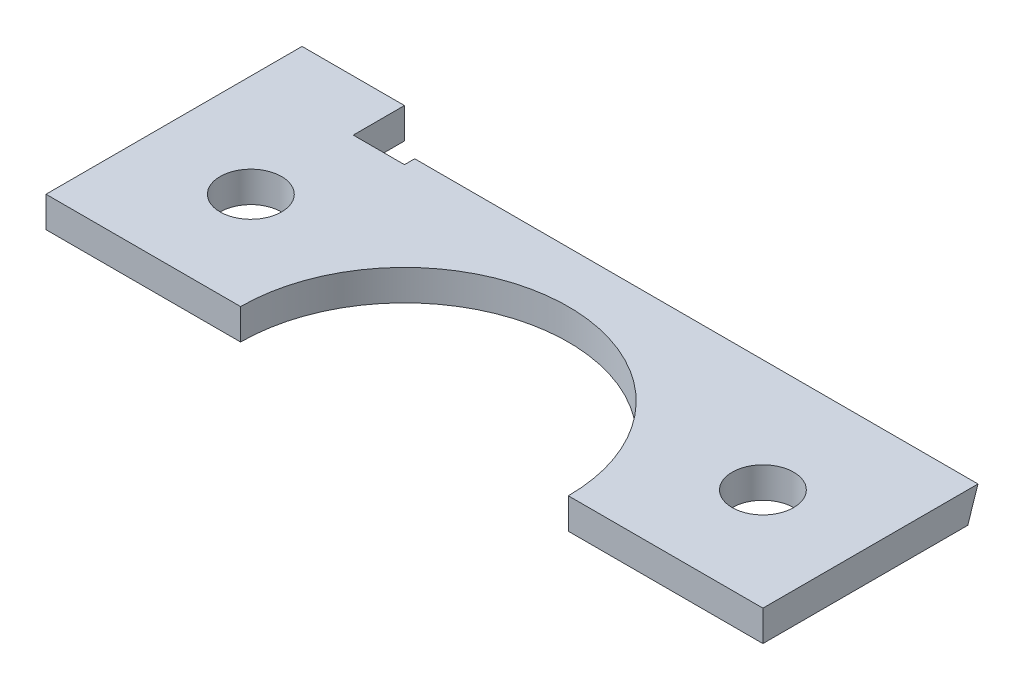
ISO-10303-21;
HEADER;
FILE_DESCRIPTION(('STEP AP214'),'2;1');
FILE_NAME('part.step','',(''),(''),'','','');
FILE_SCHEMA(('AUTOMOTIVE_DESIGN { 1 0 10303 214 1 1 1 1 }'));
ENDSEC;
DATA;
#1=APPLICATION_CONTEXT('core data for automotive mechanical design processes');
#2=APPLICATION_PROTOCOL_DEFINITION('international standard','automotive_design',2000,#1);
#3=PRODUCT_CONTEXT('',#1,'mechanical');
#4=PRODUCT('Part','Part','',(#3));
#5=PRODUCT_RELATED_PRODUCT_CATEGORY('part','',(#4));
#6=PRODUCT_DEFINITION_FORMATION('','',#4);
#7=PRODUCT_DEFINITION_CONTEXT('part definition',#1,'design');
#8=PRODUCT_DEFINITION('design','',#6,#7);
#9=PRODUCT_DEFINITION_SHAPE('','',#8);
#10=(LENGTH_UNIT() NAMED_UNIT(*) SI_UNIT(.MILLI.,.METRE.));
#11=(NAMED_UNIT(*) PLANE_ANGLE_UNIT() SI_UNIT($,.RADIAN.));
#12=(NAMED_UNIT(*) SI_UNIT($,.STERADIAN.) SOLID_ANGLE_UNIT());
#13=UNCERTAINTY_MEASURE_WITH_UNIT(LENGTH_MEASURE(1.E-05),#10,'distance_accuracy_value','');
#14=(GEOMETRIC_REPRESENTATION_CONTEXT(3) GLOBAL_UNCERTAINTY_ASSIGNED_CONTEXT((#13)) GLOBAL_UNIT_ASSIGNED_CONTEXT((#10,
#11,#12)) REPRESENTATION_CONTEXT('',''));
#15=CARTESIAN_POINT('',(0.,0.,0.));
#16=DIRECTION('',(0.,0.,1.));
#17=DIRECTION('',(1.,0.,0.));
#18=AXIS2_PLACEMENT_3D('',#15,#16,#17);
#19=CARTESIAN_POINT('',(35.,3.,0.));
#20=DIRECTION('',(0.,1.,0.));
#21=DIRECTION('',(0.,0.,1.));
#22=AXIS2_PLACEMENT_3D('',#19,#20,#21);
#23=PLANE('',#22);
#24=CARTESIAN_POINT('',(10.,3.,-10.));
#25=DIRECTION('',(0.,1.,0.));
#26=DIRECTION('',(0.,0.,1.));
#27=AXIS2_PLACEMENT_3D('',#24,#25,#26);
#28=CIRCLE('',#27,3.);
#29=CARTESIAN_POINT('',(10.,3.,-7.));
#30=VERTEX_POINT('',#29);
#31=EDGE_CURVE('E189',#30,#30,#28,.T.);
#32=ORIENTED_EDGE('',*,*,#31,.F.);
#33=EDGE_LOOP('',(#32));
#34=FACE_BOUND('',#33,.T.);
#35=DIRECTION('',(0.,0.,1.));
#36=VECTOR('',#35,1.);
#37=CARTESIAN_POINT('',(0.,3.,0.));
#38=LINE('',#37,#36);
#39=CARTESIAN_POINT('',(0.,3.,-25.));
#40=VERTEX_POINT('',#39);
#41=CARTESIAN_POINT('',(0.,3.,0.));
#42=VERTEX_POINT('',#41);
#43=EDGE_CURVE('E142',#40,#42,#38,.T.);
#44=ORIENTED_EDGE('',*,*,#43,.T.);
#45=DIRECTION('',(1.,0.,0.));
#46=VECTOR('',#45,1.);
#47=CARTESIAN_POINT('',(0.,3.,0.));
#48=LINE('',#47,#46);
#49=CARTESIAN_POINT('',(19.,3.,0.));
#50=VERTEX_POINT('',#49);
#51=EDGE_CURVE('E144',#42,#50,#48,.T.);
#52=ORIENTED_EDGE('',*,*,#51,.T.);
#53=CARTESIAN_POINT('',(35.,3.,0.));
#54=DIRECTION('',(0.,-1.,0.));
#55=DIRECTION('',(0.,0.,1.));
#56=AXIS2_PLACEMENT_3D('',#53,#54,#55);
#57=CIRCLE('',#56,16.);
#58=CARTESIAN_POINT('',(51.,3.,0.));
#59=VERTEX_POINT('',#58);
#60=EDGE_CURVE('E146',#50,#59,#57,.T.);
#61=ORIENTED_EDGE('',*,*,#60,.T.);
#62=DIRECTION('',(1.,0.,0.));
#63=VECTOR('',#62,1.);
#64=CARTESIAN_POINT('',(51.,3.,0.));
#65=LINE('',#64,#63);
#66=CARTESIAN_POINT('',(70.,3.,0.));
#67=VERTEX_POINT('',#66);
#68=EDGE_CURVE('E148',#59,#67,#65,.T.);
#69=ORIENTED_EDGE('',*,*,#68,.T.);
#70=DIRECTION('',(0.,0.,-1.));
#71=VECTOR('',#70,1.);
#72=CARTESIAN_POINT('',(70.,3.,0.));
#73=LINE('',#72,#71);
#74=CARTESIAN_POINT('',(70.,3.,-21.));
#75=VERTEX_POINT('',#74);
#76=EDGE_CURVE('E150',#67,#75,#73,.T.);
#77=ORIENTED_EDGE('',*,*,#76,.T.);
#78=DIRECTION('',(-1.,0.,0.));
#79=VECTOR('',#78,1.);
#80=CARTESIAN_POINT('',(15.,3.,-21.));
#81=LINE('',#80,#79);
#82=CARTESIAN_POINT('',(15.,3.,-21.));
#83=VERTEX_POINT('',#82);
#84=EDGE_CURVE('E109',#75,#83,#81,.T.);
#85=ORIENTED_EDGE('',*,*,#84,.T.);
#86=DIRECTION('',(0.,0.,1.));
#87=VECTOR('',#86,1.);
#88=CARTESIAN_POINT('',(15.,3.,-20.));
#89=LINE('',#88,#87);
#90=CARTESIAN_POINT('',(15.,3.,-20.));
#91=VERTEX_POINT('',#90);
#92=EDGE_CURVE('E153',#83,#91,#89,.T.);
#93=ORIENTED_EDGE('',*,*,#92,.T.);
#94=DIRECTION('',(-1.,0.,0.));
#95=VECTOR('',#94,1.);
#96=CARTESIAN_POINT('',(10.,3.,-20.));
#97=LINE('',#96,#95);
#98=CARTESIAN_POINT('',(10.,3.,-20.));
#99=VERTEX_POINT('',#98);
#100=EDGE_CURVE('E155',#91,#99,#97,.T.);
#101=ORIENTED_EDGE('',*,*,#100,.T.);
#102=DIRECTION('',(0.,0.,-1.));
#103=VECTOR('',#102,1.);
#104=CARTESIAN_POINT('',(10.,3.,-20.));
#105=LINE('',#104,#103);
#106=CARTESIAN_POINT('',(10.,3.,-25.));
#107=VERTEX_POINT('',#106);
#108=EDGE_CURVE('E50',#99,#107,#105,.T.);
#109=ORIENTED_EDGE('',*,*,#108,.T.);
#110=DIRECTION('',(-1.,0.,0.));
#111=VECTOR('',#110,1.);
#112=CARTESIAN_POINT('',(0.,3.,-25.));
#113=LINE('',#112,#111);
#114=EDGE_CURVE('E45',#107,#40,#113,.T.);
#115=ORIENTED_EDGE('',*,*,#114,.T.);
#116=EDGE_LOOP('',(#44,#52,#61,#69,#77,#85,#93,#101,#109,#115));
#117=FACE_BOUND('',#116,.T.);
#118=CARTESIAN_POINT('',(60.,3.,-10.));
#119=DIRECTION('',(0.,1.,0.));
#120=DIRECTION('',(0.,0.,1.));
#121=AXIS2_PLACEMENT_3D('',#118,#119,#120);
#122=CIRCLE('',#121,3.00000000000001);
#123=CARTESIAN_POINT('',(60.,3.,-6.99999999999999));
#124=VERTEX_POINT('',#123);
#125=EDGE_CURVE('E195',#124,#124,#122,.T.);
#126=ORIENTED_EDGE('',*,*,#125,.F.);
#127=EDGE_LOOP('',(#126));
#128=FACE_BOUND('',#127,.T.);
#129=ADVANCED_FACE('F30',(#34,#117,#128),#23,.T.);
#130=CARTESIAN_POINT('',(35.,0.,0.));
#131=DIRECTION('',(0.,1.,0.));
#132=DIRECTION('',(0.,0.,1.));
#133=AXIS2_PLACEMENT_3D('',#130,#131,#132);
#134=PLANE('',#133);
#135=CARTESIAN_POINT('',(10.,0.,-10.));
#136=DIRECTION('',(0.,1.,0.));
#137=DIRECTION('',(0.,0.,1.));
#138=AXIS2_PLACEMENT_3D('',#135,#136,#137);
#139=CIRCLE('',#138,3.);
#140=CARTESIAN_POINT('',(10.,0.,-7.));
#141=VERTEX_POINT('',#140);
#142=EDGE_CURVE('E192',#141,#141,#139,.T.);
#143=ORIENTED_EDGE('',*,*,#142,.T.);
#144=EDGE_LOOP('',(#143));
#145=FACE_BOUND('',#144,.T.);
#146=DIRECTION('',(-1.,0.,0.));
#147=VECTOR('',#146,1.);
#148=CARTESIAN_POINT('',(10.,0.,-20.));
#149=LINE('',#148,#147);
#150=CARTESIAN_POINT('',(15.,0.,-20.));
#151=VERTEX_POINT('',#150);
#152=CARTESIAN_POINT('',(10.,0.,-20.));
#153=VERTEX_POINT('',#152);
#154=EDGE_CURVE('E124',#151,#153,#149,.T.);
#155=ORIENTED_EDGE('',*,*,#154,.F.);
#156=DIRECTION('',(1.,0.,0.));
#157=VECTOR('',#156,1.);
#158=CARTESIAN_POINT('',(15.,0.,-20.));
#159=LINE('',#158,#157);
#160=CARTESIAN_POINT('',(70.,0.,-20.));
#161=VERTEX_POINT('',#160);
#162=EDGE_CURVE('E106',#151,#161,#159,.T.);
#163=ORIENTED_EDGE('',*,*,#162,.T.);
#164=DIRECTION('',(0.,0.,-1.));
#165=VECTOR('',#164,1.);
#166=CARTESIAN_POINT('',(70.,0.,0.));
#167=LINE('',#166,#165);
#168=CARTESIAN_POINT('',(70.,0.,0.));
#169=VERTEX_POINT('',#168);
#170=EDGE_CURVE('E122',#169,#161,#167,.T.);
#171=ORIENTED_EDGE('',*,*,#170,.F.);
#172=DIRECTION('',(1.,0.,0.));
#173=VECTOR('',#172,1.);
#174=CARTESIAN_POINT('',(51.,0.,0.));
#175=LINE('',#174,#173);
#176=CARTESIAN_POINT('',(51.,0.,0.));
#177=VERTEX_POINT('',#176);
#178=EDGE_CURVE('E131',#177,#169,#175,.T.);
#179=ORIENTED_EDGE('',*,*,#178,.F.);
#180=CARTESIAN_POINT('',(35.,0.,0.));
#181=DIRECTION('',(0.,-1.,0.));
#182=DIRECTION('',(0.,0.,1.));
#183=AXIS2_PLACEMENT_3D('',#180,#181,#182);
#184=CIRCLE('',#183,16.);
#185=CARTESIAN_POINT('',(19.,0.,0.));
#186=VERTEX_POINT('',#185);
#187=EDGE_CURVE('E135',#186,#177,#184,.T.);
#188=ORIENTED_EDGE('',*,*,#187,.F.);
#189=DIRECTION('',(1.,0.,0.));
#190=VECTOR('',#189,1.);
#191=CARTESIAN_POINT('',(0.,0.,0.));
#192=LINE('',#191,#190);
#193=CARTESIAN_POINT('',(0.,0.,0.));
#194=VERTEX_POINT('',#193);
#195=EDGE_CURVE('E183',#194,#186,#192,.T.);
#196=ORIENTED_EDGE('',*,*,#195,.F.);
#197=DIRECTION('',(0.,0.,1.));
#198=VECTOR('',#197,1.);
#199=CARTESIAN_POINT('',(0.,0.,0.));
#200=LINE('',#199,#198);
#201=CARTESIAN_POINT('',(0.,0.,-25.));
#202=VERTEX_POINT('',#201);
#203=EDGE_CURVE('E184',#202,#194,#200,.T.);
#204=ORIENTED_EDGE('',*,*,#203,.F.);
#205=DIRECTION('',(-1.,0.,0.));
#206=VECTOR('',#205,1.);
#207=CARTESIAN_POINT('',(0.,0.,-25.));
#208=LINE('',#207,#206);
#209=CARTESIAN_POINT('',(10.,0.,-25.));
#210=VERTEX_POINT('',#209);
#211=EDGE_CURVE('E140',#210,#202,#208,.T.);
#212=ORIENTED_EDGE('',*,*,#211,.F.);
#213=DIRECTION('',(0.,0.,-1.));
#214=VECTOR('',#213,1.);
#215=CARTESIAN_POINT('',(10.,0.,-20.));
#216=LINE('',#215,#214);
#217=EDGE_CURVE('E133',#153,#210,#216,.T.);
#218=ORIENTED_EDGE('',*,*,#217,.F.);
#219=EDGE_LOOP('',(#155,#163,#171,#179,#188,#196,#204,#212,#218));
#220=FACE_BOUND('',#219,.T.);
#221=CARTESIAN_POINT('',(60.,0.,-10.));
#222=DIRECTION('',(0.,1.,0.));
#223=DIRECTION('',(0.,0.,1.));
#224=AXIS2_PLACEMENT_3D('',#221,#222,#223);
#225=CIRCLE('',#224,3.00000000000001);
#226=CARTESIAN_POINT('',(60.,0.,-6.99999999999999));
#227=VERTEX_POINT('',#226);
#228=EDGE_CURVE('E125',#227,#227,#225,.T.);
#229=ORIENTED_EDGE('',*,*,#228,.T.);
#230=EDGE_LOOP('',(#229));
#231=FACE_BOUND('',#230,.T.);
#232=ADVANCED_FACE('F119',(#145,#220,#231),#134,.F.);
#233=CARTESIAN_POINT('',(0.,3.,0.));
#234=DIRECTION('',(1.,0.,0.));
#235=DIRECTION('',(0.,0.,-1.));
#236=AXIS2_PLACEMENT_3D('',#233,#234,#235);
#237=PLANE('',#236);
#238=ORIENTED_EDGE('',*,*,#203,.T.);
#239=DIRECTION('',(0.,-1.,0.));
#240=VECTOR('',#239,1.);
#241=CARTESIAN_POINT('',(0.,3.,0.));
#242=LINE('',#241,#240);
#243=EDGE_CURVE('E11',#42,#194,#242,.T.);
#244=ORIENTED_EDGE('',*,*,#243,.F.);
#245=ORIENTED_EDGE('',*,*,#43,.F.);
#246=DIRECTION('',(0.,-1.,0.));
#247=VECTOR('',#246,1.);
#248=CARTESIAN_POINT('',(0.,3.,-25.));
#249=LINE('',#248,#247);
#250=EDGE_CURVE('E159',#40,#202,#249,.T.);
#251=ORIENTED_EDGE('',*,*,#250,.T.);
#252=EDGE_LOOP('',(#238,#244,#245,#251));
#253=FACE_BOUND('',#252,.T.);
#254=ADVANCED_FACE('F32',(#253),#237,.F.);
#255=CARTESIAN_POINT('',(0.,3.,0.));
#256=DIRECTION('',(0.,0.,-1.));
#257=DIRECTION('',(-1.,0.,0.));
#258=AXIS2_PLACEMENT_3D('',#255,#256,#257);
#259=PLANE('',#258);
#260=ORIENTED_EDGE('',*,*,#195,.T.);
#261=DIRECTION('',(0.,-1.,0.));
#262=VECTOR('',#261,1.);
#263=CARTESIAN_POINT('',(19.,3.,0.));
#264=LINE('',#263,#262);
#265=EDGE_CURVE('E38',#50,#186,#264,.T.);
#266=ORIENTED_EDGE('',*,*,#265,.F.);
#267=ORIENTED_EDGE('',*,*,#51,.F.);
#268=ORIENTED_EDGE('',*,*,#243,.T.);
#269=EDGE_LOOP('',(#260,#266,#267,#268));
#270=FACE_BOUND('',#269,.T.);
#271=ADVANCED_FACE('F219',(#270),#259,.F.);
#272=CARTESIAN_POINT('',(35.,3.,0.));
#273=DIRECTION('',(0.,-1.,0.));
#274=DIRECTION('',(0.,0.,-1.));
#275=AXIS2_PLACEMENT_3D('',#272,#273,#274);
#276=CYLINDRICAL_SURFACE('',#275,16.);
#277=ORIENTED_EDGE('',*,*,#187,.T.);
#278=DIRECTION('',(0.,-1.,0.));
#279=VECTOR('',#278,1.);
#280=CARTESIAN_POINT('',(51.,3.,0.));
#281=LINE('',#280,#279);
#282=EDGE_CURVE('E172',#59,#177,#281,.T.);
#283=ORIENTED_EDGE('',*,*,#282,.F.);
#284=ORIENTED_EDGE('',*,*,#60,.F.);
#285=ORIENTED_EDGE('',*,*,#265,.T.);
#286=EDGE_LOOP('',(#277,#283,#284,#285));
#287=FACE_BOUND('',#286,.T.);
#288=ADVANCED_FACE('F179',(#287),#276,.F.);
#289=CARTESIAN_POINT('',(51.,3.,0.));
#290=DIRECTION('',(0.,0.,-1.));
#291=DIRECTION('',(-1.,0.,0.));
#292=AXIS2_PLACEMENT_3D('',#289,#290,#291);
#293=PLANE('',#292);
#294=ORIENTED_EDGE('',*,*,#178,.T.);
#295=DIRECTION('',(0.,-1.,0.));
#296=VECTOR('',#295,1.);
#297=CARTESIAN_POINT('',(70.,3.,0.));
#298=LINE('',#297,#296);
#299=EDGE_CURVE('E130',#67,#169,#298,.T.);
#300=ORIENTED_EDGE('',*,*,#299,.F.);
#301=ORIENTED_EDGE('',*,*,#68,.F.);
#302=ORIENTED_EDGE('',*,*,#282,.T.);
#303=EDGE_LOOP('',(#294,#300,#301,#302));
#304=FACE_BOUND('',#303,.T.);
#305=ADVANCED_FACE('F211',(#304),#293,.F.);
#306=CARTESIAN_POINT('',(70.,3.,0.));
#307=DIRECTION('',(-1.,0.,0.));
#308=DIRECTION('',(0.,0.,1.));
#309=AXIS2_PLACEMENT_3D('',#306,#307,#308);
#310=PLANE('',#309);
#311=ORIENTED_EDGE('',*,*,#170,.T.);
#312=DIRECTION('',(0.,-0.948683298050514,0.316227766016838));
#313=VECTOR('',#312,1.);
#314=CARTESIAN_POINT('',(70.,0.,-20.));
#315=LINE('',#314,#313);
#316=EDGE_CURVE('E103',#75,#161,#315,.T.);
#317=ORIENTED_EDGE('',*,*,#316,.F.);
#318=ORIENTED_EDGE('',*,*,#76,.F.);
#319=ORIENTED_EDGE('',*,*,#299,.T.);
#320=EDGE_LOOP('',(#311,#317,#318,#319));
#321=FACE_BOUND('',#320,.T.);
#322=ADVANCED_FACE('F128',(#321),#310,.F.);
#323=CARTESIAN_POINT('',(15.,3.,-20.));
#324=DIRECTION('',(1.,0.,0.));
#325=DIRECTION('',(0.,0.,-1.));
#326=AXIS2_PLACEMENT_3D('',#323,#324,#325);
#327=PLANE('',#326);
#328=ORIENTED_EDGE('',*,*,#92,.F.);
#329=DIRECTION('',(0.,-0.948683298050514,0.316227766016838));
#330=VECTOR('',#329,1.);
#331=CARTESIAN_POINT('',(15.,0.,-20.));
#332=LINE('',#331,#330);
#333=EDGE_CURVE('E114',#83,#151,#332,.T.);
#334=ORIENTED_EDGE('',*,*,#333,.T.);
#335=DIRECTION('',(0.,-1.,0.));
#336=VECTOR('',#335,1.);
#337=CARTESIAN_POINT('',(15.,3.,-20.));
#338=LINE('',#337,#336);
#339=EDGE_CURVE('E168',#91,#151,#338,.T.);
#340=ORIENTED_EDGE('',*,*,#339,.F.);
#341=EDGE_LOOP('',(#328,#334,#340));
#342=FACE_BOUND('',#341,.T.);
#343=ADVANCED_FACE('F203',(#342),#327,.F.);
#344=CARTESIAN_POINT('',(10.,3.,-20.));
#345=DIRECTION('',(0.,0.,1.));
#346=DIRECTION('',(1.,0.,0.));
#347=AXIS2_PLACEMENT_3D('',#344,#345,#346);
#348=PLANE('',#347);
#349=ORIENTED_EDGE('',*,*,#154,.T.);
#350=DIRECTION('',(0.,-1.,0.));
#351=VECTOR('',#350,1.);
#352=CARTESIAN_POINT('',(10.,3.,-20.));
#353=LINE('',#352,#351);
#354=EDGE_CURVE('E165',#99,#153,#353,.T.);
#355=ORIENTED_EDGE('',*,*,#354,.F.);
#356=ORIENTED_EDGE('',*,*,#100,.F.);
#357=ORIENTED_EDGE('',*,*,#339,.T.);
#358=EDGE_LOOP('',(#349,#355,#356,#357));
#359=FACE_BOUND('',#358,.T.);
#360=ADVANCED_FACE('F206',(#359),#348,.F.);
#361=CARTESIAN_POINT('',(10.,3.,-20.));
#362=DIRECTION('',(-1.,0.,0.));
#363=DIRECTION('',(0.,0.,1.));
#364=AXIS2_PLACEMENT_3D('',#361,#362,#363);
#365=PLANE('',#364);
#366=ORIENTED_EDGE('',*,*,#217,.T.);
#367=DIRECTION('',(0.,-1.,0.));
#368=VECTOR('',#367,1.);
#369=CARTESIAN_POINT('',(10.,3.,-25.));
#370=LINE('',#369,#368);
#371=EDGE_CURVE('E162',#107,#210,#370,.T.);
#372=ORIENTED_EDGE('',*,*,#371,.F.);
#373=ORIENTED_EDGE('',*,*,#108,.F.);
#374=ORIENTED_EDGE('',*,*,#354,.T.);
#375=EDGE_LOOP('',(#366,#372,#373,#374));
#376=FACE_BOUND('',#375,.T.);
#377=ADVANCED_FACE('F236',(#376),#365,.F.);
#378=CARTESIAN_POINT('',(0.,3.,-25.));
#379=DIRECTION('',(0.,0.,1.));
#380=DIRECTION('',(1.,0.,0.));
#381=AXIS2_PLACEMENT_3D('',#378,#379,#380);
#382=PLANE('',#381);
#383=ORIENTED_EDGE('',*,*,#211,.T.);
#384=ORIENTED_EDGE('',*,*,#250,.F.);
#385=ORIENTED_EDGE('',*,*,#114,.F.);
#386=ORIENTED_EDGE('',*,*,#371,.T.);
#387=EDGE_LOOP('',(#383,#384,#385,#386));
#388=FACE_BOUND('',#387,.T.);
#389=ADVANCED_FACE('F232',(#388),#382,.F.);
#390=CARTESIAN_POINT('',(10.,3.,-10.));
#391=DIRECTION('',(0.,-1.,0.));
#392=DIRECTION('',(0.,0.,-1.));
#393=AXIS2_PLACEMENT_3D('',#390,#391,#392);
#394=CYLINDRICAL_SURFACE('',#393,3.);
#395=ORIENTED_EDGE('',*,*,#31,.T.);
#396=EDGE_LOOP('',(#395));
#397=FACE_BOUND('',#396,.T.);
#398=ORIENTED_EDGE('',*,*,#142,.F.);
#399=EDGE_LOOP('',(#398));
#400=FACE_BOUND('',#399,.T.);
#401=ADVANCED_FACE('F235',(#397,#400),#394,.F.);
#402=CARTESIAN_POINT('',(60.,3.,-10.));
#403=DIRECTION('',(0.,-1.,0.));
#404=DIRECTION('',(0.,0.,-1.));
#405=AXIS2_PLACEMENT_3D('',#402,#403,#404);
#406=CYLINDRICAL_SURFACE('',#405,3.00000000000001);
#407=ORIENTED_EDGE('',*,*,#125,.T.);
#408=EDGE_LOOP('',(#407));
#409=FACE_BOUND('',#408,.T.);
#410=ORIENTED_EDGE('',*,*,#228,.F.);
#411=EDGE_LOOP('',(#410));
#412=FACE_BOUND('',#411,.T.);
#413=ADVANCED_FACE('F267',(#409,#412),#406,.F.);
#414=CARTESIAN_POINT('',(15.,0.,-20.));
#415=DIRECTION('',(0.,0.316227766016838,0.948683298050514));
#416=DIRECTION('',(0.,-0.948683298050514,0.316227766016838));
#417=AXIS2_PLACEMENT_3D('',#414,#415,#416);
#418=PLANE('',#417);
#419=ORIENTED_EDGE('',*,*,#316,.T.);
#420=ORIENTED_EDGE('',*,*,#162,.F.);
#421=ORIENTED_EDGE('',*,*,#333,.F.);
#422=ORIENTED_EDGE('',*,*,#84,.F.);
#423=EDGE_LOOP('',(#419,#420,#421,#422));
#424=FACE_BOUND('',#423,.T.);
#425=ADVANCED_FACE('F105',(#424),#418,.F.);
#426=CLOSED_SHELL('',(#129,#232,#254,#271,#288,#305,#322,#343,#360,#377,#389,#401,#413,#425));
#427=MANIFOLD_SOLID_BREP('B2',#426);
#428=ADVANCED_BREP_SHAPE_REPRESENTATION('',(#18,#427),#14);
#429=SHAPE_DEFINITION_REPRESENTATION(#9,#428);
ENDSEC;
END-ISO-10303-21;
